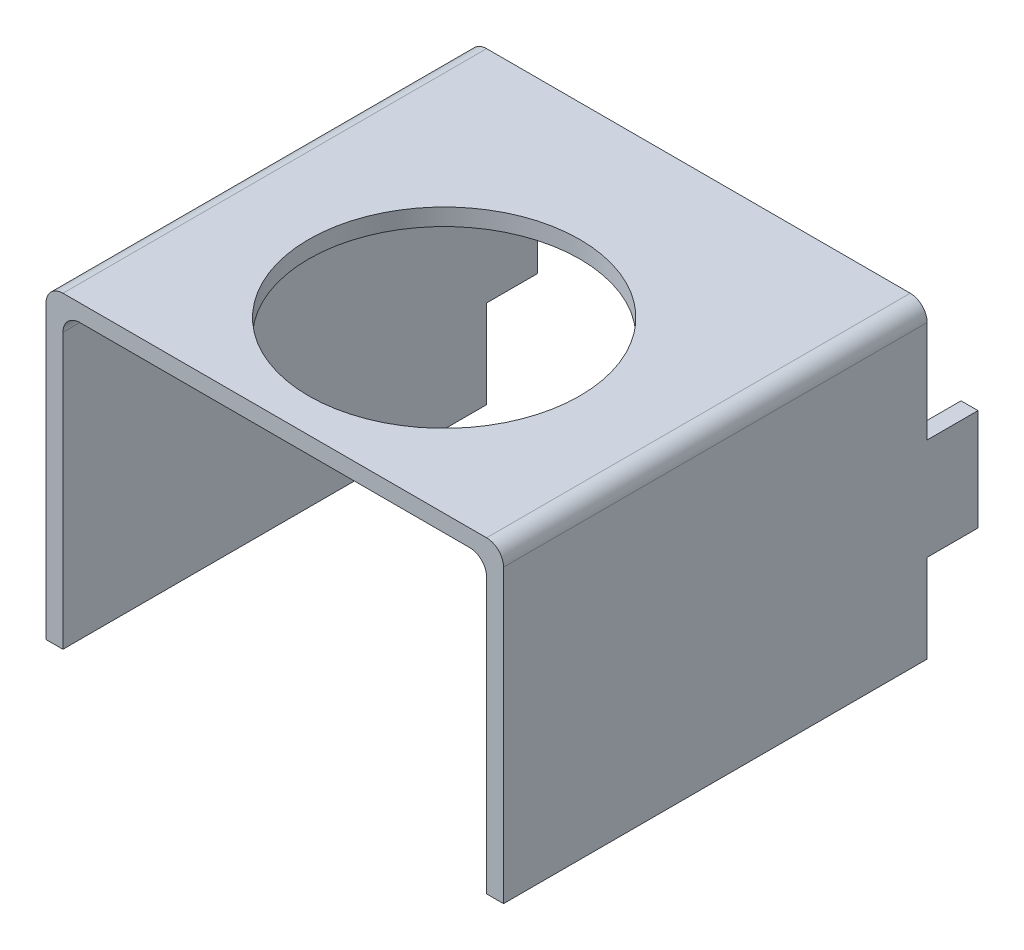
ISO-10303-21;
HEADER;
FILE_DESCRIPTION(('STEP AP214'),'2;1');
FILE_NAME('part.step','',(''),(''),'','','');
FILE_SCHEMA(('AUTOMOTIVE_DESIGN { 1 0 10303 214 1 1 1 1 }'));
ENDSEC;
DATA;
#1=APPLICATION_CONTEXT('core data for automotive mechanical design processes');
#2=APPLICATION_PROTOCOL_DEFINITION('international standard','automotive_design',2000,#1);
#3=PRODUCT_CONTEXT('',#1,'mechanical');
#4=PRODUCT('Part','Part','',(#3));
#5=PRODUCT_RELATED_PRODUCT_CATEGORY('part','',(#4));
#6=PRODUCT_DEFINITION_FORMATION('','',#4);
#7=PRODUCT_DEFINITION_CONTEXT('part definition',#1,'design');
#8=PRODUCT_DEFINITION('design','',#6,#7);
#9=PRODUCT_DEFINITION_SHAPE('','',#8);
#10=(LENGTH_UNIT() NAMED_UNIT(*) SI_UNIT(.MILLI.,.METRE.));
#11=(NAMED_UNIT(*) PLANE_ANGLE_UNIT() SI_UNIT($,.RADIAN.));
#12=(NAMED_UNIT(*) SI_UNIT($,.STERADIAN.) SOLID_ANGLE_UNIT());
#13=UNCERTAINTY_MEASURE_WITH_UNIT(LENGTH_MEASURE(1.E-05),#10,'distance_accuracy_value','');
#14=(GEOMETRIC_REPRESENTATION_CONTEXT(3) GLOBAL_UNCERTAINTY_ASSIGNED_CONTEXT((#13)) GLOBAL_UNIT_ASSIGNED_CONTEXT((#10,
#11,#12)) REPRESENTATION_CONTEXT('',''));
#15=CARTESIAN_POINT('',(0.,0.,0.));
#16=DIRECTION('',(0.,0.,1.));
#17=DIRECTION('',(1.,0.,0.));
#18=AXIS2_PLACEMENT_3D('',#15,#16,#17);
#19=CARTESIAN_POINT('',(0.,0.,0.));
#20=DIRECTION('',(0.,0.,-1.));
#21=DIRECTION('',(-1.,0.,0.));
#22=AXIS2_PLACEMENT_3D('',#19,#20,#21);
#23=PLANE('',#22);
#24=DIRECTION('',(0.,1.,0.));
#25=VECTOR('',#24,1.);
#26=CARTESIAN_POINT('',(67.5,45.5,0.));
#27=LINE('',#26,#25);
#28=CARTESIAN_POINT('',(67.5,10.5,0.));
#29=VERTEX_POINT('',#28);
#30=CARTESIAN_POINT('',(67.5,40.5,0.));
#31=VERTEX_POINT('',#30);
#32=EDGE_CURVE('E48',#29,#31,#27,.T.);
#33=ORIENTED_EDGE('',*,*,#32,.F.);
#34=DIRECTION('',(1.,0.,0.));
#35=VECTOR('',#34,1.);
#36=CARTESIAN_POINT('',(62.5,10.5,0.));
#37=LINE('',#36,#35);
#38=CARTESIAN_POINT('',(62.5,10.5,0.));
#39=VERTEX_POINT('',#38);
#40=EDGE_CURVE('E192',#39,#29,#37,.T.);
#41=ORIENTED_EDGE('',*,*,#40,.F.);
#42=DIRECTION('',(0.,1.,0.));
#43=VECTOR('',#42,1.);
#44=CARTESIAN_POINT('',(62.5,0.,0.));
#45=LINE('',#44,#43);
#46=CARTESIAN_POINT('',(62.5,35.5,0.));
#47=VERTEX_POINT('',#46);
#48=EDGE_CURVE('E230',#39,#47,#45,.T.);
#49=ORIENTED_EDGE('',*,*,#48,.T.);
#50=CARTESIAN_POINT('',(57.5,35.5,0.));
#51=DIRECTION('',(0.,0.,-1.));
#52=DIRECTION('',(-1.,0.,0.));
#53=AXIS2_PLACEMENT_3D('',#50,#51,#52);
#54=CIRCLE('',#53,5.);
#55=CARTESIAN_POINT('',(57.5,40.5,0.));
#56=VERTEX_POINT('',#55);
#57=EDGE_CURVE('E41',#47,#56,#54,.F.);
#58=ORIENTED_EDGE('',*,*,#57,.T.);
#59=DIRECTION('',(-1.,0.,0.));
#60=VECTOR('',#59,1.);
#61=CARTESIAN_POINT('',(0.,40.5,0.));
#62=LINE('',#61,#60);
#63=CARTESIAN_POINT('',(-57.5,40.5,0.));
#64=VERTEX_POINT('',#63);
#65=EDGE_CURVE('E232',#56,#64,#62,.T.);
#66=ORIENTED_EDGE('',*,*,#65,.T.);
#67=CARTESIAN_POINT('',(-57.5,35.5,0.));
#68=DIRECTION('',(0.,0.,-1.));
#69=DIRECTION('',(-1.,0.,0.));
#70=AXIS2_PLACEMENT_3D('',#67,#68,#69);
#71=CIRCLE('',#70,5.);
#72=CARTESIAN_POINT('',(-62.5,35.5,0.));
#73=VERTEX_POINT('',#72);
#74=EDGE_CURVE('E310',#64,#73,#71,.F.);
#75=ORIENTED_EDGE('',*,*,#74,.T.);
#76=DIRECTION('',(0.,-1.,0.));
#77=VECTOR('',#76,1.);
#78=CARTESIAN_POINT('',(-62.5,0.,0.));
#79=LINE('',#78,#77);
#80=CARTESIAN_POINT('',(-62.5,10.5,0.));
#81=VERTEX_POINT('',#80);
#82=EDGE_CURVE('E228',#73,#81,#79,.T.);
#83=ORIENTED_EDGE('',*,*,#82,.T.);
#84=DIRECTION('',(1.,0.,0.));
#85=VECTOR('',#84,1.);
#86=CARTESIAN_POINT('',(-62.5,10.5,0.));
#87=LINE('',#86,#85);
#88=CARTESIAN_POINT('',(-67.5,10.5,0.));
#89=VERTEX_POINT('',#88);
#90=EDGE_CURVE('E196',#89,#81,#87,.T.);
#91=ORIENTED_EDGE('',*,*,#90,.F.);
#92=DIRECTION('',(0.,-1.,0.));
#93=VECTOR('',#92,1.);
#94=CARTESIAN_POINT('',(-67.5,45.5,0.));
#95=LINE('',#94,#93);
#96=CARTESIAN_POINT('',(-67.5,40.5,0.));
#97=VERTEX_POINT('',#96);
#98=EDGE_CURVE('E266',#97,#89,#95,.T.);
#99=ORIENTED_EDGE('',*,*,#98,.F.);
#100=CARTESIAN_POINT('',(-62.5,40.5,0.));
#101=DIRECTION('',(0.,0.,-1.));
#102=DIRECTION('',(-1.,0.,0.));
#103=AXIS2_PLACEMENT_3D('',#100,#101,#102);
#104=CIRCLE('',#103,5.);
#105=CARTESIAN_POINT('',(-62.5,45.5,0.));
#106=VERTEX_POINT('',#105);
#107=EDGE_CURVE('E294',#97,#106,#104,.T.);
#108=ORIENTED_EDGE('',*,*,#107,.T.);
#109=DIRECTION('',(-1.,0.,0.));
#110=VECTOR('',#109,1.);
#111=CARTESIAN_POINT('',(67.5,45.5,0.));
#112=LINE('',#111,#110);
#113=CARTESIAN_POINT('',(62.5,45.5,0.));
#114=VERTEX_POINT('',#113);
#115=EDGE_CURVE('E255',#114,#106,#112,.T.);
#116=ORIENTED_EDGE('',*,*,#115,.F.);
#117=CARTESIAN_POINT('',(62.5,40.5,0.));
#118=DIRECTION('',(0.,0.,-1.));
#119=DIRECTION('',(-1.,0.,0.));
#120=AXIS2_PLACEMENT_3D('',#117,#118,#119);
#121=CIRCLE('',#120,5.);
#122=EDGE_CURVE('E292',#114,#31,#121,.T.);
#123=ORIENTED_EDGE('',*,*,#122,.T.);
#124=EDGE_LOOP('',(#33,#41,#49,#58,#66,#75,#83,#91,#99,#108,#116,#123));
#125=FACE_BOUND('',#124,.T.);
#126=ADVANCED_FACE('F32',(#125),#23,.T.);
#127=CARTESIAN_POINT('',(62.5,-45.5,0.));
#128=VERTEX_POINT('',#127);
#129=CARTESIAN_POINT('',(62.5,-19.5,0.));
#130=VERTEX_POINT('',#129);
#131=EDGE_CURVE('E236',#128,#130,#45,.T.);
#132=ORIENTED_EDGE('',*,*,#131,.T.);
#133=DIRECTION('',(-1.,0.,0.));
#134=VECTOR('',#133,1.);
#135=CARTESIAN_POINT('',(62.5,-19.5,0.));
#136=LINE('',#135,#134);
#137=CARTESIAN_POINT('',(67.5,-19.5,0.));
#138=VERTEX_POINT('',#137);
#139=EDGE_CURVE('E56',#138,#130,#136,.T.);
#140=ORIENTED_EDGE('',*,*,#139,.F.);
#141=CARTESIAN_POINT('',(67.5,-45.5,0.));
#142=VERTEX_POINT('',#141);
#143=EDGE_CURVE('E273',#142,#138,#27,.T.);
#144=ORIENTED_EDGE('',*,*,#143,.F.);
#145=DIRECTION('',(1.,0.,0.));
#146=VECTOR('',#145,1.);
#147=CARTESIAN_POINT('',(67.5,-45.5,0.));
#148=LINE('',#147,#146);
#149=EDGE_CURVE('E269',#128,#142,#148,.T.);
#150=ORIENTED_EDGE('',*,*,#149,.F.);
#151=EDGE_LOOP('',(#132,#140,#144,#150));
#152=FACE_BOUND('',#151,.T.);
#153=ADVANCED_FACE('F336',(#152),#23,.T.);
#154=CARTESIAN_POINT('',(67.5,-45.5,125.));
#155=DIRECTION('',(0.,1.,0.));
#156=DIRECTION('',(-1.,0.,0.));
#157=AXIS2_PLACEMENT_3D('',#154,#155,#156);
#158=PLANE('',#157);
#159=DIRECTION('',(0.,0.,-1.));
#160=VECTOR('',#159,1.);
#161=CARTESIAN_POINT('',(-62.5,-45.5,125.));
#162=LINE('',#161,#160);
#163=CARTESIAN_POINT('',(-62.5,-45.5,125.));
#164=VERTEX_POINT('',#163);
#165=CARTESIAN_POINT('',(-62.5,-45.5,0.));
#166=VERTEX_POINT('',#165);
#167=EDGE_CURVE('E241',#164,#166,#162,.T.);
#168=ORIENTED_EDGE('',*,*,#167,.F.);
#169=DIRECTION('',(1.,0.,0.));
#170=VECTOR('',#169,1.);
#171=CARTESIAN_POINT('',(67.5,-45.5,125.));
#172=LINE('',#171,#170);
#173=CARTESIAN_POINT('',(-67.5,-45.5,125.));
#174=VERTEX_POINT('',#173);
#175=EDGE_CURVE('E256',#174,#164,#172,.T.);
#176=ORIENTED_EDGE('',*,*,#175,.F.);
#177=DIRECTION('',(0.,0.,-1.));
#178=VECTOR('',#177,1.);
#179=CARTESIAN_POINT('',(-67.5,-45.5,125.));
#180=LINE('',#179,#178);
#181=CARTESIAN_POINT('',(-67.5,-45.5,0.));
#182=VERTEX_POINT('',#181);
#183=EDGE_CURVE('E279',#174,#182,#180,.T.);
#184=ORIENTED_EDGE('',*,*,#183,.T.);
#185=EDGE_CURVE('E270',#182,#166,#148,.T.);
#186=ORIENTED_EDGE('',*,*,#185,.T.);
#187=EDGE_LOOP('',(#168,#176,#184,#186));
#188=FACE_BOUND('',#187,.T.);
#189=ADVANCED_FACE('F362',(#188),#158,.F.);
#190=CARTESIAN_POINT('',(0.,0.,125.));
#191=DIRECTION('',(0.,0.,-1.));
#192=DIRECTION('',(-1.,0.,0.));
#193=AXIS2_PLACEMENT_3D('',#190,#191,#192);
#194=PLANE('',#193);
#195=DIRECTION('',(-1.,0.,0.));
#196=VECTOR('',#195,1.);
#197=CARTESIAN_POINT('',(67.5,45.5,125.));
#198=LINE('',#197,#196);
#199=CARTESIAN_POINT('',(62.5,45.5,125.));
#200=VERTEX_POINT('',#199);
#201=CARTESIAN_POINT('',(-62.5,45.5,125.));
#202=VERTEX_POINT('',#201);
#203=EDGE_CURVE('E262',#200,#202,#198,.T.);
#204=ORIENTED_EDGE('',*,*,#203,.T.);
#205=CARTESIAN_POINT('',(-62.5,40.5,125.));
#206=DIRECTION('',(0.,0.,-1.));
#207=DIRECTION('',(-1.,0.,0.));
#208=AXIS2_PLACEMENT_3D('',#205,#206,#207);
#209=CIRCLE('',#208,5.);
#210=CARTESIAN_POINT('',(-67.5,40.5,125.));
#211=VERTEX_POINT('',#210);
#212=EDGE_CURVE('E303',#202,#211,#209,.F.);
#213=ORIENTED_EDGE('',*,*,#212,.T.);
#214=DIRECTION('',(0.,-1.,0.));
#215=VECTOR('',#214,1.);
#216=CARTESIAN_POINT('',(-67.5,45.5,125.));
#217=LINE('',#216,#215);
#218=EDGE_CURVE('E252',#211,#174,#217,.T.);
#219=ORIENTED_EDGE('',*,*,#218,.T.);
#220=ORIENTED_EDGE('',*,*,#175,.T.);
#221=DIRECTION('',(0.,-1.,0.));
#222=VECTOR('',#221,1.);
#223=CARTESIAN_POINT('',(-62.5,0.,125.));
#224=LINE('',#223,#222);
#225=CARTESIAN_POINT('',(-62.5,35.5,125.));
#226=VERTEX_POINT('',#225);
#227=EDGE_CURVE('E235',#226,#164,#224,.T.);
#228=ORIENTED_EDGE('',*,*,#227,.F.);
#229=CARTESIAN_POINT('',(-57.5,35.5,125.));
#230=DIRECTION('',(0.,0.,-1.));
#231=DIRECTION('',(-1.,0.,0.));
#232=AXIS2_PLACEMENT_3D('',#229,#230,#231);
#233=CIRCLE('',#232,5.);
#234=CARTESIAN_POINT('',(-57.5,40.5,125.));
#235=VERTEX_POINT('',#234);
#236=EDGE_CURVE('E312',#226,#235,#233,.T.);
#237=ORIENTED_EDGE('',*,*,#236,.T.);
#238=DIRECTION('',(-1.,0.,0.));
#239=VECTOR('',#238,1.);
#240=CARTESIAN_POINT('',(0.,40.5,125.));
#241=LINE('',#240,#239);
#242=CARTESIAN_POINT('',(57.5,40.5,125.));
#243=VERTEX_POINT('',#242);
#244=EDGE_CURVE('E242',#243,#235,#241,.T.);
#245=ORIENTED_EDGE('',*,*,#244,.F.);
#246=CARTESIAN_POINT('',(57.5,35.5,125.));
#247=DIRECTION('',(0.,0.,-1.));
#248=DIRECTION('',(-1.,0.,0.));
#249=AXIS2_PLACEMENT_3D('',#246,#247,#248);
#250=CIRCLE('',#249,5.);
#251=CARTESIAN_POINT('',(62.5,35.5,125.));
#252=VERTEX_POINT('',#251);
#253=EDGE_CURVE('E11',#243,#252,#250,.T.);
#254=ORIENTED_EDGE('',*,*,#253,.T.);
#255=DIRECTION('',(0.,1.,0.));
#256=VECTOR('',#255,1.);
#257=CARTESIAN_POINT('',(62.5,0.,125.));
#258=LINE('',#257,#256);
#259=CARTESIAN_POINT('',(62.5,-45.5,125.));
#260=VERTEX_POINT('',#259);
#261=EDGE_CURVE('E243',#260,#252,#258,.T.);
#262=ORIENTED_EDGE('',*,*,#261,.F.);
#263=CARTESIAN_POINT('',(67.5,-45.5,125.));
#264=VERTEX_POINT('',#263);
#265=EDGE_CURVE('E254',#260,#264,#172,.T.);
#266=ORIENTED_EDGE('',*,*,#265,.T.);
#267=DIRECTION('',(0.,1.,0.));
#268=VECTOR('',#267,1.);
#269=CARTESIAN_POINT('',(67.5,45.5,125.));
#270=LINE('',#269,#268);
#271=CARTESIAN_POINT('',(67.5,40.5,125.));
#272=VERTEX_POINT('',#271);
#273=EDGE_CURVE('E259',#264,#272,#270,.T.);
#274=ORIENTED_EDGE('',*,*,#273,.T.);
#275=CARTESIAN_POINT('',(62.5,40.5,125.));
#276=DIRECTION('',(0.,0.,-1.));
#277=DIRECTION('',(-1.,0.,0.));
#278=AXIS2_PLACEMENT_3D('',#275,#276,#277);
#279=CIRCLE('',#278,5.);
#280=EDGE_CURVE('E301',#272,#200,#279,.F.);
#281=ORIENTED_EDGE('',*,*,#280,.T.);
#282=EDGE_LOOP('',(#204,#213,#219,#220,#228,#237,#245,#254,#262,#266,#274,#281));
#283=FACE_BOUND('',#282,.T.);
#284=ADVANCED_FACE('F327',(#283),#194,.F.);
#285=DIRECTION('',(-1.,0.,0.));
#286=VECTOR('',#285,1.);
#287=CARTESIAN_POINT('',(-62.5,-19.5,0.));
#288=LINE('',#287,#286);
#289=CARTESIAN_POINT('',(-62.5,-19.5,0.));
#290=VERTEX_POINT('',#289);
#291=CARTESIAN_POINT('',(-67.5,-19.5,0.));
#292=VERTEX_POINT('',#291);
#293=EDGE_CURVE('E193',#290,#292,#288,.T.);
#294=ORIENTED_EDGE('',*,*,#293,.F.);
#295=EDGE_CURVE('E231',#290,#166,#79,.T.);
#296=ORIENTED_EDGE('',*,*,#295,.T.);
#297=ORIENTED_EDGE('',*,*,#185,.F.);
#298=EDGE_CURVE('E251',#292,#182,#95,.T.);
#299=ORIENTED_EDGE('',*,*,#298,.F.);
#300=EDGE_LOOP('',(#294,#296,#297,#299));
#301=FACE_BOUND('',#300,.T.);
#302=ADVANCED_FACE('F358',(#301),#23,.T.);
#303=CARTESIAN_POINT('',(-67.5,45.5,125.));
#304=DIRECTION('',(1.,0.,0.));
#305=DIRECTION('',(0.,1.,0.));
#306=AXIS2_PLACEMENT_3D('',#303,#304,#305);
#307=PLANE('',#306);
#308=ORIENTED_EDGE('',*,*,#218,.F.);
#309=DIRECTION('',(0.,0.,-1.));
#310=VECTOR('',#309,1.);
#311=CARTESIAN_POINT('',(-67.5,40.5,125.));
#312=LINE('',#311,#310);
#313=EDGE_CURVE('E289',#211,#97,#312,.T.);
#314=ORIENTED_EDGE('',*,*,#313,.T.);
#315=ORIENTED_EDGE('',*,*,#98,.T.);
#316=DIRECTION('',(0.,0.,1.));
#317=VECTOR('',#316,1.);
#318=CARTESIAN_POINT('',(-67.5,10.5,-15.));
#319=LINE('',#318,#317);
#320=CARTESIAN_POINT('',(-67.5,10.5,-15.));
#321=VERTEX_POINT('',#320);
#322=EDGE_CURVE('E216',#321,#89,#319,.T.);
#323=ORIENTED_EDGE('',*,*,#322,.F.);
#324=DIRECTION('',(0.,1.,0.));
#325=VECTOR('',#324,1.);
#326=CARTESIAN_POINT('',(-67.5,10.5,-15.));
#327=LINE('',#326,#325);
#328=CARTESIAN_POINT('',(-67.5,-19.5,-15.));
#329=VERTEX_POINT('',#328);
#330=EDGE_CURVE('E207',#329,#321,#327,.T.);
#331=ORIENTED_EDGE('',*,*,#330,.F.);
#332=DIRECTION('',(0.,0.,1.));
#333=VECTOR('',#332,1.);
#334=CARTESIAN_POINT('',(-67.5,-19.5,-15.));
#335=LINE('',#334,#333);
#336=EDGE_CURVE('E219',#329,#292,#335,.T.);
#337=ORIENTED_EDGE('',*,*,#336,.T.);
#338=ORIENTED_EDGE('',*,*,#298,.T.);
#339=ORIENTED_EDGE('',*,*,#183,.F.);
#340=EDGE_LOOP('',(#308,#314,#315,#323,#331,#337,#338,#339));
#341=FACE_BOUND('',#340,.T.);
#342=ADVANCED_FACE('F366',(#341),#307,.F.);
#343=ORIENTED_EDGE('',*,*,#265,.F.);
#344=DIRECTION('',(0.,0.,-1.));
#345=VECTOR('',#344,1.);
#346=CARTESIAN_POINT('',(62.5,-45.5,125.));
#347=LINE('',#346,#345);
#348=EDGE_CURVE('E238',#260,#128,#347,.T.);
#349=ORIENTED_EDGE('',*,*,#348,.T.);
#350=ORIENTED_EDGE('',*,*,#149,.T.);
#351=DIRECTION('',(0.,0.,-1.));
#352=VECTOR('',#351,1.);
#353=CARTESIAN_POINT('',(67.5,-45.5,125.));
#354=LINE('',#353,#352);
#355=EDGE_CURVE('E265',#264,#142,#354,.T.);
#356=ORIENTED_EDGE('',*,*,#355,.F.);
#357=EDGE_LOOP('',(#343,#349,#350,#356));
#358=FACE_BOUND('',#357,.T.);
#359=ADVANCED_FACE('F334',(#358),#158,.F.);
#360=CARTESIAN_POINT('',(67.5,45.5,125.));
#361=DIRECTION('',(-1.,0.,0.));
#362=DIRECTION('',(0.,-1.,0.));
#363=AXIS2_PLACEMENT_3D('',#360,#361,#362);
#364=PLANE('',#363);
#365=ORIENTED_EDGE('',*,*,#143,.T.);
#366=DIRECTION('',(0.,0.,1.));
#367=VECTOR('',#366,1.);
#368=CARTESIAN_POINT('',(67.5,-19.5,-15.));
#369=LINE('',#368,#367);
#370=CARTESIAN_POINT('',(67.5,-19.5,-15.));
#371=VERTEX_POINT('',#370);
#372=EDGE_CURVE('E177',#371,#138,#369,.T.);
#373=ORIENTED_EDGE('',*,*,#372,.F.);
#374=DIRECTION('',(0.,-1.,0.));
#375=VECTOR('',#374,1.);
#376=CARTESIAN_POINT('',(67.5,10.5,-15.));
#377=LINE('',#376,#375);
#378=CARTESIAN_POINT('',(67.5,10.5,-15.));
#379=VERTEX_POINT('',#378);
#380=EDGE_CURVE('E170',#379,#371,#377,.T.);
#381=ORIENTED_EDGE('',*,*,#380,.F.);
#382=DIRECTION('',(0.,0.,1.));
#383=VECTOR('',#382,1.);
#384=CARTESIAN_POINT('',(67.5,10.5,-15.));
#385=LINE('',#384,#383);
#386=EDGE_CURVE('E174',#379,#29,#385,.T.);
#387=ORIENTED_EDGE('',*,*,#386,.T.);
#388=ORIENTED_EDGE('',*,*,#32,.T.);
#389=DIRECTION('',(0.,0.,-1.));
#390=VECTOR('',#389,1.);
#391=CARTESIAN_POINT('',(67.5,40.5,125.));
#392=LINE('',#391,#390);
#393=EDGE_CURVE('E308',#31,#272,#392,.F.);
#394=ORIENTED_EDGE('',*,*,#393,.T.);
#395=ORIENTED_EDGE('',*,*,#273,.F.);
#396=ORIENTED_EDGE('',*,*,#355,.T.);
#397=EDGE_LOOP('',(#365,#373,#381,#387,#388,#394,#395,#396));
#398=FACE_BOUND('',#397,.T.);
#399=ADVANCED_FACE('F172',(#398),#364,.F.);
#400=CARTESIAN_POINT('',(67.5,45.5,125.));
#401=DIRECTION('',(0.,-1.,0.));
#402=DIRECTION('',(1.,0.,0.));
#403=AXIS2_PLACEMENT_3D('',#400,#401,#402);
#404=PLANE('',#403);
#405=CARTESIAN_POINT('',(0.,45.5,75.));
#406=DIRECTION('',(0.,1.,0.));
#407=DIRECTION('',(-1.,0.,0.));
#408=AXIS2_PLACEMENT_3D('',#405,#406,#407);
#409=CIRCLE('',#408,40.);
#410=CARTESIAN_POINT('',(-40.,45.5,75.));
#411=VERTEX_POINT('',#410);
#412=EDGE_CURVE('E225',#411,#411,#409,.T.);
#413=ORIENTED_EDGE('',*,*,#412,.F.);
#414=EDGE_LOOP('',(#413));
#415=FACE_BOUND('',#414,.T.);
#416=ORIENTED_EDGE('',*,*,#115,.T.);
#417=DIRECTION('',(0.,0.,-1.));
#418=VECTOR('',#417,1.);
#419=CARTESIAN_POINT('',(-62.5,45.5,125.));
#420=LINE('',#419,#418);
#421=EDGE_CURVE('E299',#106,#202,#420,.F.);
#422=ORIENTED_EDGE('',*,*,#421,.T.);
#423=ORIENTED_EDGE('',*,*,#203,.F.);
#424=DIRECTION('',(0.,0.,-1.));
#425=VECTOR('',#424,1.);
#426=CARTESIAN_POINT('',(62.5,45.5,125.));
#427=LINE('',#426,#425);
#428=EDGE_CURVE('E296',#200,#114,#427,.T.);
#429=ORIENTED_EDGE('',*,*,#428,.T.);
#430=EDGE_LOOP('',(#416,#422,#423,#429));
#431=FACE_BOUND('',#430,.T.);
#432=ADVANCED_FACE('F403',(#415,#431),#404,.F.);
#433=CARTESIAN_POINT('',(-62.5,45.5,125.));
#434=DIRECTION('',(1.,0.,0.));
#435=DIRECTION('',(0.,1.,0.));
#436=AXIS2_PLACEMENT_3D('',#433,#434,#435);
#437=PLANE('',#436);
#438=ORIENTED_EDGE('',*,*,#82,.F.);
#439=DIRECTION('',(0.,0.,-1.));
#440=VECTOR('',#439,1.);
#441=CARTESIAN_POINT('',(-62.5,35.5,125.));
#442=LINE('',#441,#440);
#443=EDGE_CURVE('E287',#73,#226,#442,.F.);
#444=ORIENTED_EDGE('',*,*,#443,.T.);
#445=ORIENTED_EDGE('',*,*,#227,.T.);
#446=ORIENTED_EDGE('',*,*,#167,.T.);
#447=ORIENTED_EDGE('',*,*,#295,.F.);
#448=DIRECTION('',(0.,0.,1.));
#449=VECTOR('',#448,1.);
#450=CARTESIAN_POINT('',(-62.5,-19.5,-15.));
#451=LINE('',#450,#449);
#452=CARTESIAN_POINT('',(-62.5,-19.5,-15.));
#453=VERTEX_POINT('',#452);
#454=EDGE_CURVE('E222',#453,#290,#451,.T.);
#455=ORIENTED_EDGE('',*,*,#454,.F.);
#456=DIRECTION('',(0.,-1.,0.));
#457=VECTOR('',#456,1.);
#458=CARTESIAN_POINT('',(-62.5,10.5,-15.));
#459=LINE('',#458,#457);
#460=CARTESIAN_POINT('',(-62.5,10.5,-15.));
#461=VERTEX_POINT('',#460);
#462=EDGE_CURVE('E202',#461,#453,#459,.T.);
#463=ORIENTED_EDGE('',*,*,#462,.F.);
#464=DIRECTION('',(0.,0.,1.));
#465=VECTOR('',#464,1.);
#466=CARTESIAN_POINT('',(-62.5,10.5,-15.));
#467=LINE('',#466,#465);
#468=EDGE_CURVE('E210',#461,#81,#467,.T.);
#469=ORIENTED_EDGE('',*,*,#468,.T.);
#470=EDGE_LOOP('',(#438,#444,#445,#446,#447,#455,#463,#469));
#471=FACE_BOUND('',#470,.T.);
#472=ADVANCED_FACE('F381',(#471),#437,.T.);
#473=CARTESIAN_POINT('',(62.5,45.5,125.));
#474=DIRECTION('',(-1.,0.,0.));
#475=DIRECTION('',(0.,-1.,0.));
#476=AXIS2_PLACEMENT_3D('',#473,#474,#475);
#477=PLANE('',#476);
#478=ORIENTED_EDGE('',*,*,#261,.T.);
#479=DIRECTION('',(0.,0.,-1.));
#480=VECTOR('',#479,1.);
#481=CARTESIAN_POINT('',(62.5,35.5,0.));
#482=LINE('',#481,#480);
#483=EDGE_CURVE('E305',#252,#47,#482,.T.);
#484=ORIENTED_EDGE('',*,*,#483,.T.);
#485=ORIENTED_EDGE('',*,*,#48,.F.);
#486=DIRECTION('',(0.,0.,1.));
#487=VECTOR('',#486,1.);
#488=CARTESIAN_POINT('',(62.5,10.5,-15.));
#489=LINE('',#488,#487);
#490=CARTESIAN_POINT('',(62.5,10.5,-15.));
#491=VERTEX_POINT('',#490);
#492=EDGE_CURVE('E342',#491,#39,#489,.T.);
#493=ORIENTED_EDGE('',*,*,#492,.F.);
#494=DIRECTION('',(0.,1.,0.));
#495=VECTOR('',#494,1.);
#496=CARTESIAN_POINT('',(62.5,10.5,-15.));
#497=LINE('',#496,#495);
#498=CARTESIAN_POINT('',(62.5,-19.5,-15.));
#499=VERTEX_POINT('',#498);
#500=EDGE_CURVE('E186',#499,#491,#497,.T.);
#501=ORIENTED_EDGE('',*,*,#500,.F.);
#502=DIRECTION('',(0.,0.,1.));
#503=VECTOR('',#502,1.);
#504=CARTESIAN_POINT('',(62.5,-19.5,-15.));
#505=LINE('',#504,#503);
#506=EDGE_CURVE('E198',#499,#130,#505,.T.);
#507=ORIENTED_EDGE('',*,*,#506,.T.);
#508=ORIENTED_EDGE('',*,*,#131,.F.);
#509=ORIENTED_EDGE('',*,*,#348,.F.);
#510=EDGE_LOOP('',(#478,#484,#485,#493,#501,#507,#508,#509));
#511=FACE_BOUND('',#510,.T.);
#512=ADVANCED_FACE('F330',(#511),#477,.T.);
#513=CARTESIAN_POINT('',(67.5,40.5,125.));
#514=DIRECTION('',(0.,-1.,0.));
#515=DIRECTION('',(1.,0.,0.));
#516=AXIS2_PLACEMENT_3D('',#513,#514,#515);
#517=PLANE('',#516);
#518=CARTESIAN_POINT('',(0.,40.5,75.));
#519=DIRECTION('',(0.,-1.,0.));
#520=DIRECTION('',(1.,0.,0.));
#521=AXIS2_PLACEMENT_3D('',#518,#519,#520);
#522=CIRCLE('',#521,40.);
#523=CARTESIAN_POINT('',(40.,40.5,75.));
#524=VERTEX_POINT('',#523);
#525=EDGE_CURVE('E36',#524,#524,#522,.T.);
#526=ORIENTED_EDGE('',*,*,#525,.F.);
#527=EDGE_LOOP('',(#526));
#528=FACE_BOUND('',#527,.T.);
#529=ORIENTED_EDGE('',*,*,#244,.T.);
#530=DIRECTION('',(0.,0.,-1.));
#531=VECTOR('',#530,1.);
#532=CARTESIAN_POINT('',(-57.5,40.5,0.));
#533=LINE('',#532,#531);
#534=EDGE_CURVE('E284',#235,#64,#533,.T.);
#535=ORIENTED_EDGE('',*,*,#534,.T.);
#536=ORIENTED_EDGE('',*,*,#65,.F.);
#537=DIRECTION('',(0.,0.,-1.));
#538=VECTOR('',#537,1.);
#539=CARTESIAN_POINT('',(57.5,40.5,125.));
#540=LINE('',#539,#538);
#541=EDGE_CURVE('E282',#56,#243,#540,.F.);
#542=ORIENTED_EDGE('',*,*,#541,.T.);
#543=EDGE_LOOP('',(#529,#535,#536,#542));
#544=FACE_BOUND('',#543,.T.);
#545=ADVANCED_FACE('F320',(#528,#544),#517,.T.);
#546=CARTESIAN_POINT('',(-57.5,35.5,125.));
#547=DIRECTION('',(0.,0.,1.));
#548=DIRECTION('',(1.,0.,0.));
#549=AXIS2_PLACEMENT_3D('',#546,#547,#548);
#550=CYLINDRICAL_SURFACE('',#549,5.);
#551=ORIENTED_EDGE('',*,*,#236,.F.);
#552=ORIENTED_EDGE('',*,*,#443,.F.);
#553=ORIENTED_EDGE('',*,*,#74,.F.);
#554=ORIENTED_EDGE('',*,*,#534,.F.);
#555=EDGE_LOOP('',(#551,#552,#553,#554));
#556=FACE_BOUND('',#555,.T.);
#557=ADVANCED_FACE('F446',(#556),#550,.F.);
#558=CARTESIAN_POINT('',(-62.5,40.5,125.));
#559=DIRECTION('',(0.,0.,-1.));
#560=DIRECTION('',(-1.,0.,0.));
#561=AXIS2_PLACEMENT_3D('',#558,#559,#560);
#562=CYLINDRICAL_SURFACE('',#561,5.);
#563=ORIENTED_EDGE('',*,*,#212,.F.);
#564=ORIENTED_EDGE('',*,*,#421,.F.);
#565=ORIENTED_EDGE('',*,*,#107,.F.);
#566=ORIENTED_EDGE('',*,*,#313,.F.);
#567=EDGE_LOOP('',(#563,#564,#565,#566));
#568=FACE_BOUND('',#567,.T.);
#569=ADVANCED_FACE('F399',(#568),#562,.T.);
#570=CARTESIAN_POINT('',(57.5,35.5,125.));
#571=DIRECTION('',(0.,0.,1.));
#572=DIRECTION('',(1.,0.,0.));
#573=AXIS2_PLACEMENT_3D('',#570,#571,#572);
#574=CYLINDRICAL_SURFACE('',#573,5.);
#575=ORIENTED_EDGE('',*,*,#253,.F.);
#576=ORIENTED_EDGE('',*,*,#541,.F.);
#577=ORIENTED_EDGE('',*,*,#57,.F.);
#578=ORIENTED_EDGE('',*,*,#483,.F.);
#579=EDGE_LOOP('',(#575,#576,#577,#578));
#580=FACE_BOUND('',#579,.T.);
#581=ADVANCED_FACE('F324',(#580),#574,.F.);
#582=CARTESIAN_POINT('',(62.5,40.5,125.));
#583=DIRECTION('',(0.,0.,-1.));
#584=DIRECTION('',(-1.,0.,0.));
#585=AXIS2_PLACEMENT_3D('',#582,#583,#584);
#586=CYLINDRICAL_SURFACE('',#585,5.);
#587=ORIENTED_EDGE('',*,*,#280,.F.);
#588=ORIENTED_EDGE('',*,*,#393,.F.);
#589=ORIENTED_EDGE('',*,*,#122,.F.);
#590=ORIENTED_EDGE('',*,*,#428,.F.);
#591=EDGE_LOOP('',(#587,#588,#589,#590));
#592=FACE_BOUND('',#591,.T.);
#593=ADVANCED_FACE('F34',(#592),#586,.T.);
#594=CARTESIAN_POINT('',(0.,10.5,75.));
#595=DIRECTION('',(0.,1.,0.));
#596=DIRECTION('',(-1.,0.,0.));
#597=AXIS2_PLACEMENT_3D('',#594,#595,#596);
#598=CYLINDRICAL_SURFACE('',#597,40.);
#599=ORIENTED_EDGE('',*,*,#525,.T.);
#600=EDGE_LOOP('',(#599));
#601=FACE_BOUND('',#600,.T.);
#602=ORIENTED_EDGE('',*,*,#412,.T.);
#603=EDGE_LOOP('',(#602));
#604=FACE_BOUND('',#603,.T.);
#605=ADVANCED_FACE('F431',(#601,#604),#598,.F.);
#606=CARTESIAN_POINT('',(-62.5,-19.5,-15.));
#607=DIRECTION('',(0.,1.,0.));
#608=DIRECTION('',(0.,0.,1.));
#609=AXIS2_PLACEMENT_3D('',#606,#607,#608);
#610=PLANE('',#609);
#611=ORIENTED_EDGE('',*,*,#293,.T.);
#612=ORIENTED_EDGE('',*,*,#336,.F.);
#613=DIRECTION('',(-1.,0.,0.));
#614=VECTOR('',#613,1.);
#615=CARTESIAN_POINT('',(-62.5,-19.5,-15.));
#616=LINE('',#615,#614);
#617=EDGE_CURVE('E205',#453,#329,#616,.T.);
#618=ORIENTED_EDGE('',*,*,#617,.F.);
#619=ORIENTED_EDGE('',*,*,#454,.T.);
#620=EDGE_LOOP('',(#611,#612,#618,#619));
#621=FACE_BOUND('',#620,.T.);
#622=ADVANCED_FACE('F384',(#621),#610,.F.);
#623=CARTESIAN_POINT('',(-62.5,10.5,-15.));
#624=DIRECTION('',(0.,-1.,0.));
#625=DIRECTION('',(0.,0.,-1.));
#626=AXIS2_PLACEMENT_3D('',#623,#624,#625);
#627=PLANE('',#626);
#628=ORIENTED_EDGE('',*,*,#90,.T.);
#629=ORIENTED_EDGE('',*,*,#468,.F.);
#630=DIRECTION('',(1.,0.,0.));
#631=VECTOR('',#630,1.);
#632=CARTESIAN_POINT('',(-62.5,10.5,-15.));
#633=LINE('',#632,#631);
#634=EDGE_CURVE('E209',#321,#461,#633,.T.);
#635=ORIENTED_EDGE('',*,*,#634,.F.);
#636=ORIENTED_EDGE('',*,*,#322,.T.);
#637=EDGE_LOOP('',(#628,#629,#635,#636));
#638=FACE_BOUND('',#637,.T.);
#639=ADVANCED_FACE('F391',(#638),#627,.F.);
#640=CARTESIAN_POINT('',(0.,0.,-15.));
#641=DIRECTION('',(0.,0.,-1.));
#642=DIRECTION('',(-1.,0.,0.));
#643=AXIS2_PLACEMENT_3D('',#640,#641,#642);
#644=PLANE('',#643);
#645=ORIENTED_EDGE('',*,*,#462,.T.);
#646=ORIENTED_EDGE('',*,*,#617,.T.);
#647=ORIENTED_EDGE('',*,*,#330,.T.);
#648=ORIENTED_EDGE('',*,*,#634,.T.);
#649=EDGE_LOOP('',(#645,#646,#647,#648));
#650=FACE_BOUND('',#649,.T.);
#651=ADVANCED_FACE('F354',(#650),#644,.T.);
#652=CARTESIAN_POINT('',(62.5,10.5,-15.));
#653=DIRECTION('',(0.,-1.,0.));
#654=DIRECTION('',(1.,0.,0.));
#655=AXIS2_PLACEMENT_3D('',#652,#653,#654);
#656=PLANE('',#655);
#657=ORIENTED_EDGE('',*,*,#40,.T.);
#658=ORIENTED_EDGE('',*,*,#386,.F.);
#659=DIRECTION('',(1.,0.,0.));
#660=VECTOR('',#659,1.);
#661=CARTESIAN_POINT('',(62.5,10.5,-15.));
#662=LINE('',#661,#660);
#663=EDGE_CURVE('E181',#491,#379,#662,.T.);
#664=ORIENTED_EDGE('',*,*,#663,.F.);
#665=ORIENTED_EDGE('',*,*,#492,.T.);
#666=EDGE_LOOP('',(#657,#658,#664,#665));
#667=FACE_BOUND('',#666,.T.);
#668=ADVANCED_FACE('F191',(#667),#656,.F.);
#669=CARTESIAN_POINT('',(62.5,-19.5,-15.));
#670=DIRECTION('',(0.,1.,0.));
#671=DIRECTION('',(-1.,0.,0.));
#672=AXIS2_PLACEMENT_3D('',#669,#670,#671);
#673=PLANE('',#672);
#674=ORIENTED_EDGE('',*,*,#139,.T.);
#675=ORIENTED_EDGE('',*,*,#506,.F.);
#676=DIRECTION('',(-1.,0.,0.));
#677=VECTOR('',#676,1.);
#678=CARTESIAN_POINT('',(62.5,-19.5,-15.));
#679=LINE('',#678,#677);
#680=EDGE_CURVE('E180',#371,#499,#679,.T.);
#681=ORIENTED_EDGE('',*,*,#680,.F.);
#682=ORIENTED_EDGE('',*,*,#372,.T.);
#683=EDGE_LOOP('',(#674,#675,#681,#682));
#684=FACE_BOUND('',#683,.T.);
#685=ADVANCED_FACE('F339',(#684),#673,.F.);
#686=CARTESIAN_POINT('',(0.,0.,-15.));
#687=DIRECTION('',(0.,0.,-1.));
#688=DIRECTION('',(-1.,0.,0.));
#689=AXIS2_PLACEMENT_3D('',#686,#687,#688);
#690=PLANE('',#689);
#691=ORIENTED_EDGE('',*,*,#663,.T.);
#692=ORIENTED_EDGE('',*,*,#380,.T.);
#693=ORIENTED_EDGE('',*,*,#680,.T.);
#694=ORIENTED_EDGE('',*,*,#500,.T.);
#695=EDGE_LOOP('',(#691,#692,#693,#694));
#696=FACE_BOUND('',#695,.T.);
#697=ADVANCED_FACE('F184',(#696),#690,.T.);
#698=CLOSED_SHELL('',(#126,#153,#189,#284,#302,#342,#359,#399,#432,#472,#512,#545,#557,#569,
#581,#593,#605,#622,#639,#651,#668,#685,#697));
#699=MANIFOLD_SOLID_BREP('B2',#698);
#700=ADVANCED_BREP_SHAPE_REPRESENTATION('',(#18,#699),#14);
#701=SHAPE_DEFINITION_REPRESENTATION(#9,#700);
ENDSEC;
END-ISO-10303-21;
